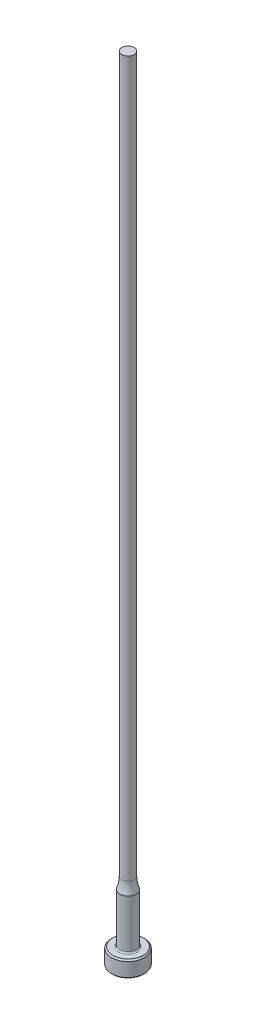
ISO-10303-21;
HEADER;
FILE_DESCRIPTION(('STEP AP214'),'2;1');
FILE_NAME('part.step','',(''),(''),'','','');
FILE_SCHEMA(('AUTOMOTIVE_DESIGN { 1 0 10303 214 1 1 1 1 }'));
ENDSEC;
DATA;
#1=APPLICATION_CONTEXT('core data for automotive mechanical design processes');
#2=APPLICATION_PROTOCOL_DEFINITION('international standard','automotive_design',2000,#1);
#3=PRODUCT_CONTEXT('',#1,'mechanical');
#4=PRODUCT('Part','Part','',(#3));
#5=PRODUCT_RELATED_PRODUCT_CATEGORY('part','',(#4));
#6=PRODUCT_DEFINITION_FORMATION('','',#4);
#7=PRODUCT_DEFINITION_CONTEXT('part definition',#1,'design');
#8=PRODUCT_DEFINITION('design','',#6,#7);
#9=PRODUCT_DEFINITION_SHAPE('','',#8);
#10=(LENGTH_UNIT() NAMED_UNIT(*) SI_UNIT(.MILLI.,.METRE.));
#11=(NAMED_UNIT(*) PLANE_ANGLE_UNIT() SI_UNIT($,.RADIAN.));
#12=(NAMED_UNIT(*) SI_UNIT($,.STERADIAN.) SOLID_ANGLE_UNIT());
#13=UNCERTAINTY_MEASURE_WITH_UNIT(LENGTH_MEASURE(1.E-05),#10,'distance_accuracy_value','');
#14=(GEOMETRIC_REPRESENTATION_CONTEXT(3) GLOBAL_UNCERTAINTY_ASSIGNED_CONTEXT((#13)) GLOBAL_UNIT_ASSIGNED_CONTEXT((#10,
#11,#12)) REPRESENTATION_CONTEXT('',''));
#15=CARTESIAN_POINT('',(0.,0.,0.));
#16=DIRECTION('',(0.,0.,1.));
#17=DIRECTION('',(1.,0.,0.));
#18=AXIS2_PLACEMENT_3D('',#15,#16,#17);
#19=CARTESIAN_POINT('',(-1.18998999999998,152.4,0.));
#20=DIRECTION('',(0.,1.,0.));
#21=DIRECTION('',(0.,0.,1.));
#22=AXIS2_PLACEMENT_3D('',#19,#20,#21);
#23=PLANE('',#22);
#24=CARTESIAN_POINT('',(0.,152.4,0.));
#25=DIRECTION('',(0.,1.,0.));
#26=DIRECTION('',(0.,0.,1.));
#27=AXIS2_PLACEMENT_3D('',#24,#25,#26);
#28=CIRCLE('',#27,1.18998999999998);
#29=CARTESIAN_POINT('',(0.,152.4,1.18998999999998));
#30=VERTEX_POINT('',#29);
#31=EDGE_CURVE('E61',#30,#30,#28,.T.);
#32=ORIENTED_EDGE('',*,*,#31,.T.);
#33=EDGE_LOOP('',(#32));
#34=FACE_BOUND('',#33,.T.);
#35=ADVANCED_FACE('F35',(#34),#23,.T.);
#36=CARTESIAN_POINT('',(0.,259.958771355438,0.));
#37=DIRECTION('',(0.,1.,0.));
#38=DIRECTION('',(0.,0.,1.));
#39=AXIS2_PLACEMENT_3D('',#36,#37,#38);
#40=CYLINDRICAL_SURFACE('',#39,1.18998999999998);
#41=CARTESIAN_POINT('',(0.,14.9114164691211,0.));
#42=DIRECTION('',(0.,1.,0.));
#43=DIRECTION('',(0.,0.,1.));
#44=AXIS2_PLACEMENT_3D('',#41,#42,#43);
#45=CIRCLE('',#44,1.18998999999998);
#46=CARTESIAN_POINT('',(0.,14.9114164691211,1.18998999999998));
#47=VERTEX_POINT('',#46);
#48=EDGE_CURVE('E64',#47,#47,#45,.T.);
#49=ORIENTED_EDGE('',*,*,#48,.T.);
#50=EDGE_LOOP('',(#49));
#51=FACE_BOUND('',#50,.T.);
#52=ORIENTED_EDGE('',*,*,#31,.F.);
#53=EDGE_LOOP('',(#52));
#54=FACE_BOUND('',#53,.T.);
#55=ADVANCED_FACE('F84',(#51,#54),#40,.T.);
#56=CARTESIAN_POINT('',(0.,14.9114164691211,0.));
#57=DIRECTION('',(0.,1.,0.));
#58=DIRECTION('',(0.,0.,1.));
#59=AXIS2_PLACEMENT_3D('',#56,#57,#58);
#60=TOROIDAL_SURFACE('',#59,7.53998999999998,6.35);
#61=CARTESIAN_POINT('',(0.,12.7,0.));
#62=DIRECTION('',(0.,1.,0.));
#63=DIRECTION('',(0.,0.,1.));
#64=AXIS2_PLACEMENT_3D('',#61,#62,#63);
#65=CIRCLE('',#64,1.58749999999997);
#66=CARTESIAN_POINT('',(0.,12.7,1.58749999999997));
#67=VERTEX_POINT('',#66);
#68=EDGE_CURVE('E67',#67,#67,#65,.T.);
#69=ORIENTED_EDGE('',*,*,#68,.T.);
#70=EDGE_LOOP('',(#69));
#71=FACE_BOUND('',#70,.T.);
#72=ORIENTED_EDGE('',*,*,#48,.F.);
#73=EDGE_LOOP('',(#72));
#74=FACE_BOUND('',#73,.T.);
#75=ADVANCED_FACE('F71',(#71,#74),#60,.F.);
#76=CARTESIAN_POINT('',(0.,259.958771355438,0.));
#77=DIRECTION('',(0.,1.,0.));
#78=DIRECTION('',(0.,0.,1.));
#79=AXIS2_PLACEMENT_3D('',#76,#77,#78);
#80=CYLINDRICAL_SURFACE('',#79,1.58749999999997);
#81=CARTESIAN_POINT('',(0.,3.42900000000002,0.));
#82=DIRECTION('',(0.,1.,0.));
#83=DIRECTION('',(0.,0.,1.));
#84=AXIS2_PLACEMENT_3D('',#81,#82,#83);
#85=CIRCLE('',#84,1.58749999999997);
#86=CARTESIAN_POINT('',(0.,3.42900000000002,1.58749999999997));
#87=VERTEX_POINT('',#86);
#88=EDGE_CURVE('E42',#87,#87,#85,.T.);
#89=ORIENTED_EDGE('',*,*,#88,.T.);
#90=EDGE_LOOP('',(#89));
#91=FACE_BOUND('',#90,.T.);
#92=ORIENTED_EDGE('',*,*,#68,.F.);
#93=EDGE_LOOP('',(#92));
#94=FACE_BOUND('',#93,.T.);
#95=ADVANCED_FACE('F74',(#91,#94),#80,.T.);
#96=CARTESIAN_POINT('',(-3.17499999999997,3.175,0.));
#97=DIRECTION('',(0.,1.,0.));
#98=DIRECTION('',(0.,0.,1.));
#99=AXIS2_PLACEMENT_3D('',#96,#97,#98);
#100=PLANE('',#99);
#101=CARTESIAN_POINT('',(0.,3.175,0.));
#102=DIRECTION('',(0.,1.,0.));
#103=DIRECTION('',(0.,0.,1.));
#104=AXIS2_PLACEMENT_3D('',#101,#102,#103);
#105=CIRCLE('',#104,1.84149999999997);
#106=CARTESIAN_POINT('',(0.,3.175,1.84149999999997));
#107=VERTEX_POINT('',#106);
#108=EDGE_CURVE('E10',#107,#107,#105,.F.);
#109=ORIENTED_EDGE('',*,*,#108,.T.);
#110=EDGE_LOOP('',(#109));
#111=FACE_BOUND('',#110,.T.);
#112=CARTESIAN_POINT('',(0.,3.175,0.));
#113=DIRECTION('',(0.,1.,0.));
#114=DIRECTION('',(0.,0.,1.));
#115=AXIS2_PLACEMENT_3D('',#112,#113,#114);
#116=CIRCLE('',#115,2.92099999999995);
#117=CARTESIAN_POINT('',(0.,3.175,2.92099999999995));
#118=VERTEX_POINT('',#117);
#119=EDGE_CURVE('E58',#118,#118,#116,.T.);
#120=ORIENTED_EDGE('',*,*,#119,.T.);
#121=EDGE_LOOP('',(#120));
#122=FACE_BOUND('',#121,.T.);
#123=ADVANCED_FACE('F76',(#111,#122),#100,.T.);
#124=CARTESIAN_POINT('',(0.,259.958771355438,0.));
#125=DIRECTION('',(0.,1.,0.));
#126=DIRECTION('',(0.,0.,1.));
#127=AXIS2_PLACEMENT_3D('',#124,#125,#126);
#128=CYLINDRICAL_SURFACE('',#127,3.17499999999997);
#129=CARTESIAN_POINT('',(0.,2.92100000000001,0.));
#130=DIRECTION('',(0.,1.,0.));
#131=DIRECTION('',(0.,0.,1.));
#132=AXIS2_PLACEMENT_3D('',#129,#130,#131);
#133=CIRCLE('',#132,3.17499999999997);
#134=CARTESIAN_POINT('',(0.,2.92100000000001,3.17499999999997));
#135=VERTEX_POINT('',#134);
#136=EDGE_CURVE('E50',#135,#135,#133,.F.);
#137=ORIENTED_EDGE('',*,*,#136,.T.);
#138=EDGE_LOOP('',(#137));
#139=FACE_BOUND('',#138,.T.);
#140=CARTESIAN_POINT('',(0.,0.254000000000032,0.));
#141=DIRECTION('',(0.,-1.,0.));
#142=DIRECTION('',(0.,0.,-1.));
#143=AXIS2_PLACEMENT_3D('',#140,#141,#142);
#144=CIRCLE('',#143,3.17499999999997);
#145=CARTESIAN_POINT('',(0.,0.254000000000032,-3.17499999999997));
#146=VERTEX_POINT('',#145);
#147=EDGE_CURVE('E55',#146,#146,#144,.F.);
#148=ORIENTED_EDGE('',*,*,#147,.T.);
#149=EDGE_LOOP('',(#148));
#150=FACE_BOUND('',#149,.T.);
#151=ADVANCED_FACE('F82',(#139,#150),#128,.T.);
#152=CARTESIAN_POINT('',(0.,0.,0.));
#153=DIRECTION('',(0.,-1.,0.));
#154=DIRECTION('',(0.,0.,-1.));
#155=AXIS2_PLACEMENT_3D('',#152,#153,#154);
#156=PLANE('',#155);
#157=CARTESIAN_POINT('',(0.,0.,0.));
#158=DIRECTION('',(0.,-1.,0.));
#159=DIRECTION('',(0.,0.,-1.));
#160=AXIS2_PLACEMENT_3D('',#157,#158,#159);
#161=CIRCLE('',#160,2.92099999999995);
#162=CARTESIAN_POINT('',(0.,0.,-2.92099999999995));
#163=VERTEX_POINT('',#162);
#164=EDGE_CURVE('E46',#163,#163,#161,.T.);
#165=ORIENTED_EDGE('',*,*,#164,.T.);
#166=EDGE_LOOP('',(#165));
#167=FACE_BOUND('',#166,.T.);
#168=ADVANCED_FACE('F98',(#167),#156,.T.);
#169=CARTESIAN_POINT('',(0.,3.17499999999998,0.));
#170=DIRECTION('',(0.,-1.,0.));
#171=DIRECTION('',(0.,0.,-1.));
#172=AXIS2_PLACEMENT_3D('',#169,#170,#171);
#173=CONICAL_SURFACE('',#172,2.92099999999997,0.7853981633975);
#174=ORIENTED_EDGE('',*,*,#136,.F.);
#175=EDGE_LOOP('',(#174));
#176=FACE_BOUND('',#175,.T.);
#177=ORIENTED_EDGE('',*,*,#119,.F.);
#178=EDGE_LOOP('',(#177));
#179=FACE_BOUND('',#178,.T.);
#180=ADVANCED_FACE('F95',(#176,#179),#173,.T.);
#181=CARTESIAN_POINT('',(0.,0.254000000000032,0.));
#182=DIRECTION('',(0.,1.,0.));
#183=DIRECTION('',(0.,0.,1.));
#184=AXIS2_PLACEMENT_3D('',#181,#182,#183);
#185=CONICAL_SURFACE('',#184,3.17499999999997,0.785398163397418);
#186=ORIENTED_EDGE('',*,*,#164,.F.);
#187=EDGE_LOOP('',(#186));
#188=FACE_BOUND('',#187,.T.);
#189=ORIENTED_EDGE('',*,*,#147,.F.);
#190=EDGE_LOOP('',(#189));
#191=FACE_BOUND('',#190,.T.);
#192=ADVANCED_FACE('F97',(#188,#191),#185,.T.);
#193=CARTESIAN_POINT('',(0.,3.42900000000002,0.));
#194=DIRECTION('',(0.,1.,0.));
#195=DIRECTION('',(0.,0.,1.));
#196=AXIS2_PLACEMENT_3D('',#193,#194,#195);
#197=TOROIDAL_SURFACE('',#196,1.84149999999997,0.254);
#198=ORIENTED_EDGE('',*,*,#108,.F.);
#199=EDGE_LOOP('',(#198));
#200=FACE_BOUND('',#199,.T.);
#201=ORIENTED_EDGE('',*,*,#88,.F.);
#202=EDGE_LOOP('',(#201));
#203=FACE_BOUND('',#202,.T.);
#204=ADVANCED_FACE('F37',(#200,#203),#197,.F.);
#205=CLOSED_SHELL('',(#35,#55,#75,#95,#123,#151,#168,#180,#192,#204));
#206=MANIFOLD_SOLID_BREP('B2',#205);
#207=ADVANCED_BREP_SHAPE_REPRESENTATION('',(#18,#206),#14);
#208=SHAPE_DEFINITION_REPRESENTATION(#9,#207);
ENDSEC;
END-ISO-10303-21;
